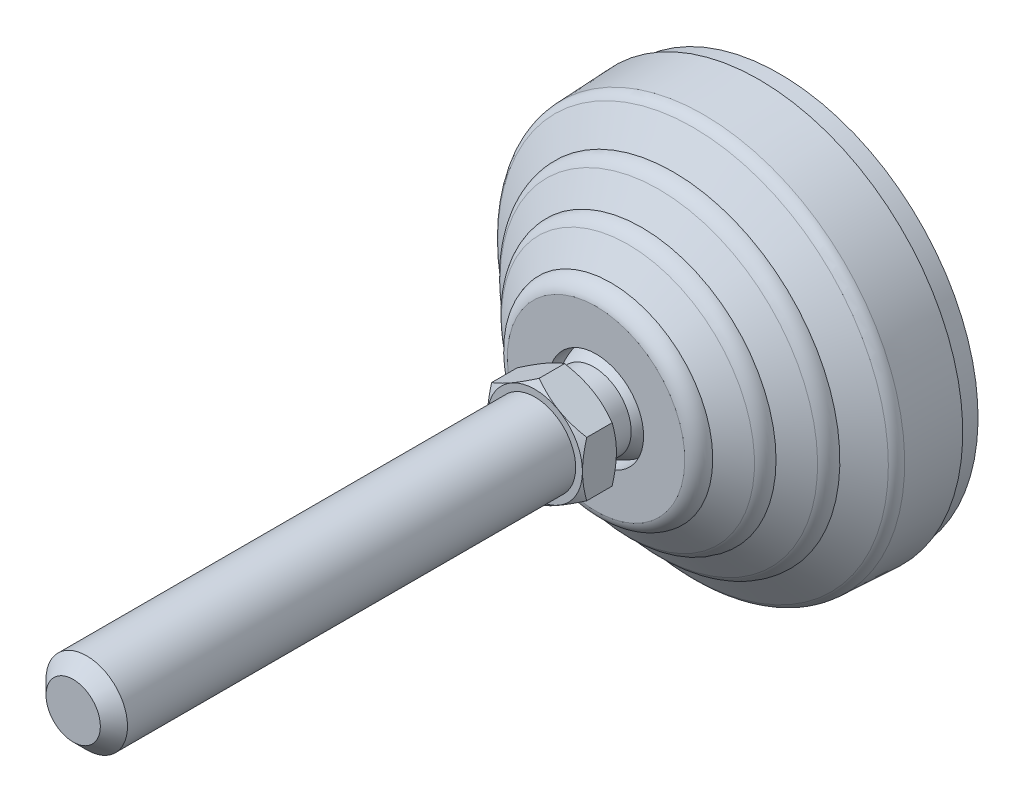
ISO-10303-21;
HEADER;
FILE_DESCRIPTION(('STEP AP214'),'2;1');
FILE_NAME('part.step','',(''),(''),'','','');
FILE_SCHEMA(('AUTOMOTIVE_DESIGN { 1 0 10303 214 1 1 1 1 }'));
ENDSEC;
DATA;
#1=APPLICATION_CONTEXT('core data for automotive mechanical design processes');
#2=APPLICATION_PROTOCOL_DEFINITION('international standard','automotive_design',2000,#1);
#3=PRODUCT_CONTEXT('',#1,'mechanical');
#4=PRODUCT('Part','Part','',(#3));
#5=PRODUCT_RELATED_PRODUCT_CATEGORY('part','',(#4));
#6=PRODUCT_DEFINITION_FORMATION('','',#4);
#7=PRODUCT_DEFINITION_CONTEXT('part definition',#1,'design');
#8=PRODUCT_DEFINITION('design','',#6,#7);
#9=PRODUCT_DEFINITION_SHAPE('','',#8);
#10=(LENGTH_UNIT() NAMED_UNIT(*) SI_UNIT(.MILLI.,.METRE.));
#11=(NAMED_UNIT(*) PLANE_ANGLE_UNIT() SI_UNIT($,.RADIAN.));
#12=(NAMED_UNIT(*) SI_UNIT($,.STERADIAN.) SOLID_ANGLE_UNIT());
#13=UNCERTAINTY_MEASURE_WITH_UNIT(LENGTH_MEASURE(1.E-05),#10,'distance_accuracy_value','');
#14=(GEOMETRIC_REPRESENTATION_CONTEXT(3) GLOBAL_UNCERTAINTY_ASSIGNED_CONTEXT((#13)) GLOBAL_UNIT_ASSIGNED_CONTEXT((#10,
#11,#12)) REPRESENTATION_CONTEXT('',''));
#15=CARTESIAN_POINT('',(0.,0.,0.));
#16=DIRECTION('',(0.,0.,1.));
#17=DIRECTION('',(1.,0.,0.));
#18=AXIS2_PLACEMENT_3D('',#15,#16,#17);
#19=CARTESIAN_POINT('',(0.,0.,35.));
#20=DIRECTION('',(0.,0.,-1.));
#21=DIRECTION('',(0.,1.,0.));
#22=AXIS2_PLACEMENT_3D('',#19,#20,#21);
#23=CYLINDRICAL_SURFACE('',#22,7.);
#24=CARTESIAN_POINT('',(-7.,0.,23.));
#25=CARTESIAN_POINT('',(-7.00000242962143,-0.114537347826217,23.));
#26=CARTESIAN_POINT('',(-6.99718891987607,-0.229074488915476,23.));
#27=CARTESIAN_POINT('',(-6.98594746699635,-0.45787295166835,23.));
#28=CARTESIAN_POINT('',(-6.97751952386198,-0.572134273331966,23.));
#29=CARTESIAN_POINT('',(-6.95506664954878,-0.800105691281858,23.));
#30=CARTESIAN_POINT('',(-6.94104171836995,-0.913815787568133,23.));
#31=CARTESIAN_POINT('',(-6.90742942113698,-1.14041085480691,23.));
#32=CARTESIAN_POINT('',(-6.88784205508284,-1.25329582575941,23.));
#33=CARTESIAN_POINT('',(-6.84315187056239,-1.47796868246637,23.));
#34=CARTESIAN_POINT('',(-6.81804905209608,-1.58975656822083,23.));
#35=CARTESIAN_POINT('',(-6.76238849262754,-1.81196595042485,23.));
#36=CARTESIAN_POINT('',(-6.73183075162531,-1.9223874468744,23.));
#37=CARTESIAN_POINT('',(-6.66533394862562,-2.14159803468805,23.));
#38=CARTESIAN_POINT('',(-6.62939488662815,-2.25038712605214,23.));
#39=CARTESIAN_POINT('',(-6.55222202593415,-2.46607082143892,23.));
#40=CARTESIAN_POINT('',(-6.51098822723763,-2.5729654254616,23.));
#41=CARTESIAN_POINT('',(-6.42332522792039,-2.78460262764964,23.));
#42=CARTESIAN_POINT('',(-6.37689602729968,-2.88934522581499,23.));
#43=CARTESIAN_POINT('',(-6.27895407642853,-3.09642608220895,23.));
#44=CARTESIAN_POINT('',(-6.22744132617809,-3.19876434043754,23.));
#45=CARTESIAN_POINT('',(-6.11945637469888,-3.40078997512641,23.));
#46=CARTESIAN_POINT('',(-6.06298417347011,-3.50047735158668,23.));
#47=CARTESIAN_POINT('',(-5.94521636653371,-3.69696106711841,23.));
#48=CARTESIAN_POINT('',(-5.88392076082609,-3.79375740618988,23.));
#49=CARTESIAN_POINT('',(-5.75665381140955,-3.98422585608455,23.));
#50=CARTESIAN_POINT('',(-5.69068246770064,-4.07789796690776,23.));
#51=CARTESIAN_POINT('',(-5.55422297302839,-4.26189229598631,23.));
#52=CARTESIAN_POINT('',(-5.48373482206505,-4.35221451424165,23.));
#53=CARTESIAN_POINT('',(-5.33841152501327,-4.52929146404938,23.));
#54=CARTESIAN_POINT('',(-5.26357637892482,-4.61604619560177,23.));
#55=CARTESIAN_POINT('',(-5.10973937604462,-4.78577917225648,23.));
#56=CARTESIAN_POINT('',(-5.03073751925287,-4.8687574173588,23.));
#57=CARTESIAN_POINT('',(-4.8687574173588,-5.03073751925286,23.));
#58=CARTESIAN_POINT('',(-4.78577917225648,-5.10973937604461,23.));
#59=CARTESIAN_POINT('',(-4.61604619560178,-5.26357637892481,23.));
#60=CARTESIAN_POINT('',(-4.52929146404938,-5.33841152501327,23.));
#61=CARTESIAN_POINT('',(-4.35221451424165,-5.48373482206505,23.));
#62=CARTESIAN_POINT('',(-4.26189229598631,-5.55422297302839,23.));
#63=CARTESIAN_POINT('',(-4.07789796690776,-5.69068246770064,23.));
#64=CARTESIAN_POINT('',(-3.98422585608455,-5.75665381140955,23.));
#65=CARTESIAN_POINT('',(-3.79375740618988,-5.88392076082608,23.));
#66=CARTESIAN_POINT('',(-3.69696106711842,-5.9452163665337,23.));
#67=CARTESIAN_POINT('',(-3.50047735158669,-6.0629841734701,23.));
#68=CARTESIAN_POINT('',(-3.40078997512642,-6.11945637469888,23.));
#69=CARTESIAN_POINT('',(-3.19876434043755,-6.22744132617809,23.));
#70=CARTESIAN_POINT('',(-3.09642608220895,-6.27895407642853,23.));
#71=CARTESIAN_POINT('',(-2.88934522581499,-6.37689602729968,23.));
#72=CARTESIAN_POINT('',(-2.78460262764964,-6.42332522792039,23.));
#73=CARTESIAN_POINT('',(-2.57296542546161,-6.51098822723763,23.));
#74=CARTESIAN_POINT('',(-2.46607082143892,-6.55222202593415,23.));
#75=CARTESIAN_POINT('',(-2.25038712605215,-6.62939488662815,23.));
#76=CARTESIAN_POINT('',(-2.14159803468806,-6.66533394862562,23.));
#77=CARTESIAN_POINT('',(-1.92238744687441,-6.73183075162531,23.));
#78=CARTESIAN_POINT('',(-1.81196595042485,-6.76238849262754,23.));
#79=CARTESIAN_POINT('',(-1.58975656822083,-6.81804905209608,23.));
#80=CARTESIAN_POINT('',(-1.47796868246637,-6.84315187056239,23.));
#81=CARTESIAN_POINT('',(-1.25329582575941,-6.88784205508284,23.));
#82=CARTESIAN_POINT('',(-1.14041085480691,-6.90742942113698,23.));
#83=CARTESIAN_POINT('',(-0.913815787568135,-6.94104171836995,23.));
#84=CARTESIAN_POINT('',(-0.80010569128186,-6.95506664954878,23.));
#85=CARTESIAN_POINT('',(-0.572134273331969,-6.97751952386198,23.));
#86=CARTESIAN_POINT('',(-0.457872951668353,-6.98594746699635,23.));
#87=CARTESIAN_POINT('',(-0.229074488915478,-6.99718891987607,23.));
#88=CARTESIAN_POINT('',(-0.11453734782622,-7.00000242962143,23.));
#89=CARTESIAN_POINT('',(0.,-7.,23.));
#90=B_SPLINE_CURVE_WITH_KNOTS('',3,(#24,#25,#26,#27,#28,#29,#30,#31,#32,#33,#34,#35,#36,#37,#38,
#39,#40,#41,#42,#43,#44,#45,#46,#47,#48,#49,#50,#51,#52,#53,#54,#55,#56,#57,#58,#59,#60,#61,#62,
#63,#64,#65,#66,#67,#68,#69,#70,#71,#72,#73,#74,#75,#76,#77,#78,#79,#80,#81,#82,#83,#84,#85,#86,
#87,#88,#89),.UNSPECIFIED.,.F.,.F.,(4,2,2,2,2,2,2,2,2,2,2,2,2,2,2,2,2,2,2,2,2,2,2,2,2,2,2,2,2,2,
2,2,4),(0.,0.343577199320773,0.687154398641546,1.03073159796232,1.37430879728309,
1.71788599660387,2.06146319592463,2.40504039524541,2.74861759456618,3.09219479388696,
3.43577199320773,3.7793491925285,4.12292639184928,4.46650359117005,4.81008079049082,
5.15365798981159,5.49723518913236,5.84081238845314,6.18438958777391,6.52796678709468,
6.87154398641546,7.21512118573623,7.558698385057,7.90227558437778,8.24585278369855,
8.58942998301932,8.93300718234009,9.27658438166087,9.62016158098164,9.96373878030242,
10.3073159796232,10.650893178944,10.9944703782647),.UNSPECIFIED.);
#91=CARTESIAN_POINT('',(-7.,0.,23.0001794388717));
#92=VERTEX_POINT('',#91);
#93=CARTESIAN_POINT('',(0.,-7.,23.));
#94=VERTEX_POINT('',#93);
#95=EDGE_CURVE('E138',#92,#94,#90,.T.);
#96=ORIENTED_EDGE('',*,*,#95,.F.);
#97=CARTESIAN_POINT('',(0.,0.,23.));
#98=DIRECTION('',(0.,0.,-1.));
#99=DIRECTION('',(0.,1.,0.));
#100=AXIS2_PLACEMENT_3D('',#97,#98,#99);
#101=CIRCLE('',#100,7.);
#102=CARTESIAN_POINT('',(0.,7.,23.));
#103=VERTEX_POINT('',#102);
#104=EDGE_CURVE('E134',#103,#92,#101,.F.);
#105=ORIENTED_EDGE('',*,*,#104,.F.);
#106=CARTESIAN_POINT('',(7.,0.,23.));
#107=CARTESIAN_POINT('',(7.00000242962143,0.114537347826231,22.9999999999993));
#108=CARTESIAN_POINT('',(6.99718891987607,0.22907448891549,22.9999999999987));
#109=CARTESIAN_POINT('',(6.98594746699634,0.457872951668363,22.9999999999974));
#110=CARTESIAN_POINT('',(6.97751952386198,0.572134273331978,22.9999999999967));
#111=CARTESIAN_POINT('',(6.95506664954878,0.800105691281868,22.9999999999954));
#112=CARTESIAN_POINT('',(6.94104171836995,0.913815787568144,22.9999999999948));
#113=CARTESIAN_POINT('',(6.90742942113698,1.14041085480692,22.9999999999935));
#114=CARTESIAN_POINT('',(6.88784205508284,1.25329582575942,22.9999999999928));
#115=CARTESIAN_POINT('',(6.84315187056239,1.47796868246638,22.9999999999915));
#116=CARTESIAN_POINT('',(6.81804905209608,1.58975656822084,22.9999999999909));
#117=CARTESIAN_POINT('',(6.76238849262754,1.81196595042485,22.9999999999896));
#118=CARTESIAN_POINT('',(6.73183075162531,1.92238744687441,22.999999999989));
#119=CARTESIAN_POINT('',(6.66533394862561,2.14159803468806,22.9999999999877));
#120=CARTESIAN_POINT('',(6.62939488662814,2.25038712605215,22.9999999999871));
#121=CARTESIAN_POINT('',(6.55222202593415,2.46607082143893,22.9999999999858));
#122=CARTESIAN_POINT('',(6.51098822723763,2.57296542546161,22.9999999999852));
#123=CARTESIAN_POINT('',(6.42332522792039,2.78460262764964,22.999999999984));
#124=CARTESIAN_POINT('',(6.37689602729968,2.88934522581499,22.9999999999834));
#125=CARTESIAN_POINT('',(6.27895407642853,3.09642608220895,22.9999999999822));
#126=CARTESIAN_POINT('',(6.22744132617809,3.19876434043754,22.9999999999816));
#127=CARTESIAN_POINT('',(6.11945637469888,3.40078997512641,22.9999999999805));
#128=CARTESIAN_POINT('',(6.06298417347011,3.50047735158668,22.9999999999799));
#129=CARTESIAN_POINT('',(5.94521636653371,3.69696106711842,22.9999999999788));
#130=CARTESIAN_POINT('',(5.88392076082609,3.79375740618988,22.9999999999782));
#131=CARTESIAN_POINT('',(5.75665381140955,3.98422585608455,22.9999999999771));
#132=CARTESIAN_POINT('',(5.69068246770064,4.07789796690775,22.9999999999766));
#133=CARTESIAN_POINT('',(5.55422297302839,4.26189229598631,22.9999999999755));
#134=CARTESIAN_POINT('',(5.48373482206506,4.35221451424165,22.999999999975));
#135=CARTESIAN_POINT('',(5.33841152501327,4.52929146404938,22.999999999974));
#136=CARTESIAN_POINT('',(5.26357637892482,4.61604619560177,22.9999999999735));
#137=CARTESIAN_POINT('',(5.10973937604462,4.78577917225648,22.9999999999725));
#138=CARTESIAN_POINT('',(5.03073751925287,4.8687574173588,22.9999999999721));
#139=CARTESIAN_POINT('',(4.8687574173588,5.03073751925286,22.9999999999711));
#140=CARTESIAN_POINT('',(4.78577917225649,5.10973937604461,22.9999999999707));
#141=CARTESIAN_POINT('',(4.61604619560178,5.26357637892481,22.9999999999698));
#142=CARTESIAN_POINT('',(4.52929146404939,5.33841152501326,22.9999999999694));
#143=CARTESIAN_POINT('',(4.35221451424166,5.48373482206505,22.9999999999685));
#144=CARTESIAN_POINT('',(4.26189229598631,5.55422297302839,22.9999999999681));
#145=CARTESIAN_POINT('',(4.07789796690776,5.69068246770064,22.9999999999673));
#146=CARTESIAN_POINT('',(3.98422585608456,5.75665381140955,22.999999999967));
#147=CARTESIAN_POINT('',(3.79375740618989,5.88392076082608,22.9999999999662));
#148=CARTESIAN_POINT('',(3.69696106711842,5.9452163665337,22.9999999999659));
#149=CARTESIAN_POINT('',(3.50047735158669,6.0629841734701,22.9999999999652));
#150=CARTESIAN_POINT('',(3.40078997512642,6.11945637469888,22.9999999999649));
#151=CARTESIAN_POINT('',(3.19876434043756,6.22744132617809,22.9999999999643));
#152=CARTESIAN_POINT('',(3.09642608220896,6.27895407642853,22.999999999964));
#153=CARTESIAN_POINT('',(2.88934522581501,6.37689602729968,22.9999999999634));
#154=CARTESIAN_POINT('',(2.78460262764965,6.42332522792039,22.9999999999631));
#155=CARTESIAN_POINT('',(2.57296542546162,6.51098822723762,22.9999999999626));
#156=CARTESIAN_POINT('',(2.46607082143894,6.55222202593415,22.9999999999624));
#157=CARTESIAN_POINT('',(2.25038712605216,6.62939488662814,22.999999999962));
#158=CARTESIAN_POINT('',(2.14159803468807,6.66533394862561,22.9999999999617));
#159=CARTESIAN_POINT('',(1.92238744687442,6.73183075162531,22.9999999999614));
#160=CARTESIAN_POINT('',(1.81196595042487,6.76238849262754,22.9999999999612));
#161=CARTESIAN_POINT('',(1.58975656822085,6.81804905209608,22.9999999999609));
#162=CARTESIAN_POINT('',(1.47796868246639,6.84315187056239,22.9999999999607));
#163=CARTESIAN_POINT('',(1.25329582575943,6.88784205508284,22.9999999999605));
#164=CARTESIAN_POINT('',(1.14041085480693,6.90742942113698,22.9999999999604));
#165=CARTESIAN_POINT('',(0.913815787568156,6.94104171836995,22.9999999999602));
#166=CARTESIAN_POINT('',(0.80010569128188,6.95506664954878,22.9999999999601));
#167=CARTESIAN_POINT('',(0.572134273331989,6.97751952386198,22.9999999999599));
#168=CARTESIAN_POINT('',(0.457872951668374,6.98594746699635,22.9999999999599));
#169=CARTESIAN_POINT('',(0.229074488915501,6.99718891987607,22.9999999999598));
#170=CARTESIAN_POINT('',(0.114537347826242,7.00000242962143,22.9999999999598));
#171=CARTESIAN_POINT('',(0.,7.,22.9999999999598));
#172=B_SPLINE_CURVE_WITH_KNOTS('',3,(#106,#107,#108,#109,#110,#111,#112,#113,#114,#115,#116,
#117,#118,#119,#120,#121,#122,#123,#124,#125,#126,#127,#128,#129,#130,#131,#132,#133,#134,#135,
#136,#137,#138,#139,#140,#141,#142,#143,#144,#145,#146,#147,#148,#149,#150,#151,#152,#153,#154,
#155,#156,#157,#158,#159,#160,#161,#162,#163,#164,#165,#166,#167,#168,#169,#170,#171),
.UNSPECIFIED.,.F.,.F.,(4,2,2,2,2,2,2,2,2,2,2,2,2,2,2,2,2,2,2,2,2,2,2,2,2,2,2,2,2,2,2,2,4),(0.,
0.343577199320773,0.687154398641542,1.03073159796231,1.37430879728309,1.71788599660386,
2.06146319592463,2.4050403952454,2.74861759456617,3.09219479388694,3.43577199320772,
3.77934919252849,4.12292639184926,4.46650359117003,4.8100807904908,5.15365798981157,
5.49723518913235,5.84081238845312,6.18438958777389,6.52796678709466,6.87154398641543,
7.21512118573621,7.55869838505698,7.90227558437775,8.24585278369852,8.58942998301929,
8.93300718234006,9.27658438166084,9.62016158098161,9.96373878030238,10.3073159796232,
10.6508931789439,10.9944703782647),.UNSPECIFIED.);
#173=CARTESIAN_POINT('',(7.,0.,23.));
#174=VERTEX_POINT('',#173);
#175=EDGE_CURVE('E31',#174,#103,#172,.T.);
#176=ORIENTED_EDGE('',*,*,#175,.F.);
#177=CARTESIAN_POINT('',(0.,0.,23.));
#178=DIRECTION('',(0.,0.,-1.));
#179=DIRECTION('',(0.,1.,0.));
#180=AXIS2_PLACEMENT_3D('',#177,#178,#179);
#181=CIRCLE('',#180,7.);
#182=EDGE_CURVE('E135',#94,#174,#181,.F.);
#183=ORIENTED_EDGE('',*,*,#182,.F.);
#184=EDGE_LOOP('',(#96,#105,#176,#183));
#185=FACE_BOUND('',#184,.T.);
#186=CARTESIAN_POINT('',(0.,0.,27.));
#187=DIRECTION('',(0.,0.,-1.));
#188=DIRECTION('',(0.,1.,0.));
#189=AXIS2_PLACEMENT_3D('',#186,#187,#188);
#190=CIRCLE('',#189,7.);
#191=CARTESIAN_POINT('',(0.,7.,27.));
#192=VERTEX_POINT('',#191);
#193=EDGE_CURVE('E161',#192,#192,#190,.T.);
#194=ORIENTED_EDGE('',*,*,#193,.F.);
#195=EDGE_LOOP('',(#194));
#196=FACE_BOUND('',#195,.T.);
#197=ADVANCED_FACE('F14',(#185,#196),#23,.F.);
#198=CARTESIAN_POINT('',(-6.53226682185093,0.,27.));
#199=DIRECTION('',(0.,0.,1.));
#200=DIRECTION('',(-1.,0.,0.));
#201=AXIS2_PLACEMENT_3D('',#198,#199,#200);
#202=PLANE('',#201);
#203=CARTESIAN_POINT('',(0.,0.,27.));
#204=DIRECTION('',(0.,0.,-1.));
#205=DIRECTION('',(0.,1.,0.));
#206=AXIS2_PLACEMENT_3D('',#203,#204,#205);
#207=CIRCLE('',#206,13.0645336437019);
#208=CARTESIAN_POINT('',(0.,13.0645336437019,27.));
#209=VERTEX_POINT('',#208);
#210=EDGE_CURVE('E157',#209,#209,#207,.T.);
#211=ORIENTED_EDGE('',*,*,#210,.F.);
#212=EDGE_LOOP('',(#211));
#213=FACE_BOUND('',#212,.T.);
#214=ORIENTED_EDGE('',*,*,#193,.T.);
#215=EDGE_LOOP('',(#214));
#216=FACE_BOUND('',#215,.T.);
#217=ADVANCED_FACE('F310',(#213,#216),#202,.T.);
#218=CARTESIAN_POINT('',(0.,0.,24.5842));
#219=DIRECTION('',(0.,0.,-1.));
#220=DIRECTION('',(0.,1.,0.));
#221=AXIS2_PLACEMENT_3D('',#218,#219,#220);
#222=TOROIDAL_SURFACE('',#221,12.5253,2.47525);
#223=ORIENTED_EDGE('',*,*,#210,.T.);
#224=EDGE_LOOP('',(#223));
#225=FACE_BOUND('',#224,.T.);
#226=CARTESIAN_POINT('',(0.,0.,24.8062186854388));
#227=DIRECTION('',(0.,0.,-1.));
#228=DIRECTION('',(-1.,0.,0.));
#229=AXIS2_PLACEMENT_3D('',#226,#227,#228);
#230=CIRCLE('',#229,14.9905728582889);
#231=CARTESIAN_POINT('',(-14.9905728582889,0.,24.8062186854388));
#232=VERTEX_POINT('',#231);
#233=EDGE_CURVE('E160',#232,#232,#230,.T.);
#234=ORIENTED_EDGE('',*,*,#233,.F.);
#235=EDGE_LOOP('',(#234));
#236=FACE_BOUND('',#235,.T.);
#237=ADVANCED_FACE('F396',(#225,#236),#222,.T.);
#238=CARTESIAN_POINT('',(0.,0.,22.3004110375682));
#239=DIRECTION('',(0.,0.,-1.));
#240=DIRECTION('',(0.,1.,0.));
#241=AXIS2_PLACEMENT_3D('',#238,#239,#240);
#242=CONICAL_SURFACE('',#241,18.63040749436,0.967870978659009);
#243=ORIENTED_EDGE('',*,*,#233,.T.);
#244=EDGE_LOOP('',(#243));
#245=FACE_BOUND('',#244,.T.);
#246=CARTESIAN_POINT('',(0.,0.,22.3004110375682));
#247=DIRECTION('',(0.,0.,-1.));
#248=DIRECTION('',(0.,1.,0.));
#249=AXIS2_PLACEMENT_3D('',#246,#247,#248);
#250=CIRCLE('',#249,18.63040749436);
#251=CARTESIAN_POINT('',(0.,18.63040749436,22.3004110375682));
#252=VERTEX_POINT('',#251);
#253=EDGE_CURVE('E390',#252,#252,#250,.T.);
#254=ORIENTED_EDGE('',*,*,#253,.F.);
#255=EDGE_LOOP('',(#254));
#256=FACE_BOUND('',#255,.T.);
#257=ADVANCED_FACE('F383',(#245,#256),#242,.T.);
#258=CARTESIAN_POINT('',(0.,0.,20.149417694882));
#259=DIRECTION('',(0.,0.,-1.));
#260=DIRECTION('',(0.,1.,0.));
#261=AXIS2_PLACEMENT_3D('',#258,#259,#260);
#262=TOROIDAL_SURFACE('',#261,17.1699621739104,2.59993709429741);
#263=CARTESIAN_POINT('',(0.,0.,20.266146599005));
#264=DIRECTION('',(0.,0.,-1.));
#265=DIRECTION('',(-1.,0.,0.));
#266=AXIS2_PLACEMENT_3D('',#263,#264,#265);
#267=CIRCLE('',#266,19.7672775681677);
#268=CARTESIAN_POINT('',(-19.7672775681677,0.,20.266146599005));
#269=VERTEX_POINT('',#268);
#270=EDGE_CURVE('E387',#269,#269,#267,.T.);
#271=ORIENTED_EDGE('',*,*,#270,.F.);
#272=EDGE_LOOP('',(#271));
#273=FACE_BOUND('',#272,.T.);
#274=ORIENTED_EDGE('',*,*,#253,.T.);
#275=EDGE_LOOP('',(#274));
#276=FACE_BOUND('',#275,.T.);
#277=ADVANCED_FACE('F379',(#273,#276),#262,.T.);
#278=CARTESIAN_POINT('',(0.,0.,17.7704000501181));
#279=DIRECTION('',(0.,0.,-1.));
#280=DIRECTION('',(0.,1.,0.));
#281=AXIS2_PLACEMENT_3D('',#278,#279,#280);
#282=CONICAL_SURFACE('',#281,23.3925000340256,0.967871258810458);
#283=CARTESIAN_POINT('',(0.,0.,17.7704000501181));
#284=DIRECTION('',(0.,0.,-1.));
#285=DIRECTION('',(0.,1.,0.));
#286=AXIS2_PLACEMENT_3D('',#283,#284,#285);
#287=CIRCLE('',#286,23.3925000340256);
#288=CARTESIAN_POINT('',(0.,23.3925000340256,17.7704000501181));
#289=VERTEX_POINT('',#288);
#290=EDGE_CURVE('E368',#289,#289,#287,.T.);
#291=ORIENTED_EDGE('',*,*,#290,.F.);
#292=EDGE_LOOP('',(#291));
#293=FACE_BOUND('',#292,.T.);
#294=ORIENTED_EDGE('',*,*,#270,.T.);
#295=EDGE_LOOP('',(#294));
#296=FACE_BOUND('',#295,.T.);
#297=ADVANCED_FACE('F375',(#293,#296),#282,.T.);
#298=CARTESIAN_POINT('',(0.,0.,15.6193000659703));
#299=DIRECTION('',(0.,0.,-1.));
#300=DIRECTION('',(0.,1.,0.));
#301=AXIS2_PLACEMENT_3D('',#298,#299,#300);
#302=TOROIDAL_SURFACE('',#301,21.9321002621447,2.59999973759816);
#303=ORIENTED_EDGE('',*,*,#290,.T.);
#304=EDGE_LOOP('',(#303));
#305=FACE_BOUND('',#304,.T.);
#306=CARTESIAN_POINT('',(0.,0.,15.6295138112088));
#307=DIRECTION('',(0.,0.,-1.));
#308=DIRECTION('',(-1.,0.,0.));
#309=AXIS2_PLACEMENT_3D('',#306,#307,#308);
#310=CIRCLE('',#309,24.5320799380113);
#311=CARTESIAN_POINT('',(-24.5320799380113,0.,15.6295138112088));
#312=VERTEX_POINT('',#311);
#313=EDGE_CURVE('E365',#312,#312,#310,.T.);
#314=ORIENTED_EDGE('',*,*,#313,.F.);
#315=EDGE_LOOP('',(#314));
#316=FACE_BOUND('',#315,.T.);
#317=ADVANCED_FACE('F372',(#305,#316),#302,.T.);
#318=CARTESIAN_POINT('',(0.,0.,12.7183562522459));
#319=DIRECTION('',(0.,0.,-1.));
#320=DIRECTION('',(0.,1.,0.));
#321=AXIS2_PLACEMENT_3D('',#318,#319,#320);
#322=CONICAL_SURFACE('',#321,28.760790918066,0.967879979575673);
#323=ORIENTED_EDGE('',*,*,#313,.T.);
#324=EDGE_LOOP('',(#323));
#325=FACE_BOUND('',#324,.T.);
#326=CARTESIAN_POINT('',(0.,0.,12.7183562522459));
#327=DIRECTION('',(0.,0.,-1.));
#328=DIRECTION('',(0.,1.,0.));
#329=AXIS2_PLACEMENT_3D('',#326,#327,#328);
#330=CIRCLE('',#329,28.760790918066);
#331=CARTESIAN_POINT('',(0.,28.760790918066,12.7183562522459));
#332=VERTEX_POINT('',#331);
#333=EDGE_CURVE('E362',#332,#332,#330,.T.);
#334=ORIENTED_EDGE('',*,*,#333,.F.);
#335=EDGE_LOOP('',(#334));
#336=FACE_BOUND('',#335,.T.);
#337=ADVANCED_FACE('F355',(#325,#336),#322,.T.);
#338=CARTESIAN_POINT('',(0.,0.,11.0710969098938));
#339=DIRECTION('',(0.,0.,-1.));
#340=DIRECTION('',(0.,1.,0.));
#341=AXIS2_PLACEMENT_3D('',#338,#339,#340);
#342=TOROIDAL_SURFACE('',#341,27.6268354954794,1.9998295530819);
#343=CARTESIAN_POINT('',(0.,0.,11.1756615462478));
#344=DIRECTION('',(0.,0.,-1.));
#345=DIRECTION('',(-1.,0.,0.));
#346=AXIS2_PLACEMENT_3D('',#343,#344,#345);
#347=CIRCLE('',#346,29.6239295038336);
#348=CARTESIAN_POINT('',(-29.6239295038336,0.,11.1756615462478));
#349=VERTEX_POINT('',#348);
#350=EDGE_CURVE('E156',#349,#349,#347,.T.);
#351=ORIENTED_EDGE('',*,*,#350,.F.);
#352=EDGE_LOOP('',(#351));
#353=FACE_BOUND('',#352,.T.);
#354=ORIENTED_EDGE('',*,*,#333,.T.);
#355=EDGE_LOOP('',(#354));
#356=FACE_BOUND('',#355,.T.);
#357=ADVANCED_FACE('F350',(#353,#356),#342,.T.);
#358=CARTESIAN_POINT('',(0.,0.,3.00000000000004));
#359=DIRECTION('',(0.,0.,-1.));
#360=DIRECTION('',(0.,1.,0.));
#361=AXIS2_PLACEMENT_3D('',#358,#359,#360);
#362=CONICAL_SURFACE('',#361,30.,0.0459663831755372);
#363=CARTESIAN_POINT('',(0.,0.,3.));
#364=DIRECTION('',(0.,0.,-1.));
#365=DIRECTION('',(0.,1.,0.));
#366=AXIS2_PLACEMENT_3D('',#363,#364,#365);
#367=CIRCLE('',#366,30.);
#368=CARTESIAN_POINT('',(0.,30.,3.));
#369=VERTEX_POINT('',#368);
#370=EDGE_CURVE('E153',#369,#369,#367,.T.);
#371=ORIENTED_EDGE('',*,*,#370,.F.);
#372=EDGE_LOOP('',(#371));
#373=FACE_BOUND('',#372,.T.);
#374=ORIENTED_EDGE('',*,*,#350,.T.);
#375=EDGE_LOOP('',(#374));
#376=FACE_BOUND('',#375,.T.);
#377=ADVANCED_FACE('F346',(#373,#376),#362,.T.);
#378=CARTESIAN_POINT('',(-29.625,0.,3.));
#379=DIRECTION('',(0.,0.,-1.));
#380=DIRECTION('',(0.,1.,0.));
#381=AXIS2_PLACEMENT_3D('',#378,#379,#380);
#382=PLANE('',#381);
#383=ORIENTED_EDGE('',*,*,#370,.T.);
#384=EDGE_LOOP('',(#383));
#385=FACE_BOUND('',#384,.T.);
#386=CARTESIAN_POINT('',(0.,0.,3.));
#387=DIRECTION('',(0.,0.,1.));
#388=DIRECTION('',(0.,-1.,0.));
#389=AXIS2_PLACEMENT_3D('',#386,#387,#388);
#390=CIRCLE('',#389,29.25);
#391=CARTESIAN_POINT('',(0.,-29.25,3.));
#392=VERTEX_POINT('',#391);
#393=EDGE_CURVE('E150',#392,#392,#390,.F.);
#394=ORIENTED_EDGE('',*,*,#393,.F.);
#395=EDGE_LOOP('',(#394));
#396=FACE_BOUND('',#395,.T.);
#397=ADVANCED_FACE('F342',(#385,#396),#382,.T.);
#398=CARTESIAN_POINT('',(0.,0.,1.5));
#399=DIRECTION('',(0.,0.,1.));
#400=DIRECTION('',(0.,-1.,0.));
#401=AXIS2_PLACEMENT_3D('',#398,#399,#400);
#402=CYLINDRICAL_SURFACE('',#401,29.25);
#403=CARTESIAN_POINT('',(0.,0.,0.));
#404=DIRECTION('',(0.,0.,1.));
#405=DIRECTION('',(0.,-1.,0.));
#406=AXIS2_PLACEMENT_3D('',#403,#404,#405);
#407=CIRCLE('',#406,29.25);
#408=CARTESIAN_POINT('',(0.,-29.25,0.));
#409=VERTEX_POINT('',#408);
#410=EDGE_CURVE('E147',#409,#409,#407,.F.);
#411=ORIENTED_EDGE('',*,*,#410,.F.);
#412=EDGE_LOOP('',(#411));
#413=FACE_BOUND('',#412,.T.);
#414=ORIENTED_EDGE('',*,*,#393,.T.);
#415=EDGE_LOOP('',(#414));
#416=FACE_BOUND('',#415,.T.);
#417=ADVANCED_FACE('F302',(#413,#416),#402,.T.);
#418=CARTESIAN_POINT('',(-14.625,0.,0.));
#419=DIRECTION('',(0.,0.,-1.));
#420=DIRECTION('',(0.,1.,0.));
#421=AXIS2_PLACEMENT_3D('',#418,#419,#420);
#422=PLANE('',#421);
#423=ORIENTED_EDGE('',*,*,#410,.T.);
#424=EDGE_LOOP('',(#423));
#425=FACE_BOUND('',#424,.T.);
#426=ADVANCED_FACE('F117',(#425),#422,.T.);
#427=CARTESIAN_POINT('',(0.,0.,56.4265));
#428=DIRECTION('',(0.,0.,-1.));
#429=DIRECTION('',(0.,1.,0.));
#430=AXIS2_PLACEMENT_3D('',#427,#428,#429);
#431=CYLINDRICAL_SURFACE('',#430,6.);
#432=CARTESIAN_POINT('',(0.,0.,102.));
#433=DIRECTION('',(0.,0.,1.));
#434=DIRECTION('',(0.,-1.,0.));
#435=AXIS2_PLACEMENT_3D('',#432,#433,#434);
#436=CIRCLE('',#435,6.);
#437=CARTESIAN_POINT('',(0.,-6.,102.));
#438=VERTEX_POINT('',#437);
#439=EDGE_CURVE('E9',#438,#438,#436,.F.);
#440=ORIENTED_EDGE('',*,*,#439,.T.);
#441=EDGE_LOOP('',(#440));
#442=FACE_BOUND('',#441,.T.);
#443=CARTESIAN_POINT('',(0.,0.,36.));
#444=DIRECTION('',(0.,0.,-1.));
#445=DIRECTION('',(0.,1.,0.));
#446=AXIS2_PLACEMENT_3D('',#443,#444,#445);
#447=CIRCLE('',#446,6.);
#448=CARTESIAN_POINT('',(0.,6.,36.));
#449=VERTEX_POINT('',#448);
#450=EDGE_CURVE('E136',#449,#449,#447,.F.);
#451=ORIENTED_EDGE('',*,*,#450,.T.);
#452=EDGE_LOOP('',(#451));
#453=FACE_BOUND('',#452,.T.);
#454=ADVANCED_FACE('F293',(#442,#453),#431,.T.);
#455=CARTESIAN_POINT('',(6.495,0.,36.));
#456=DIRECTION('',(0.,0.,1.));
#457=DIRECTION('',(0.,-1.,0.));
#458=AXIS2_PLACEMENT_3D('',#455,#456,#457);
#459=PLANE('',#458);
#460=CARTESIAN_POINT('',(0.,0.,36.));
#461=DIRECTION('',(0.,0.,-1.));
#462=DIRECTION('',(0.,1.,0.));
#463=AXIS2_PLACEMENT_3D('',#460,#461,#462);
#464=CIRCLE('',#463,6.99);
#465=CARTESIAN_POINT('',(0.,6.99,36.));
#466=VERTEX_POINT('',#465);
#467=EDGE_CURVE('E601',#466,#466,#464,.F.);
#468=ORIENTED_EDGE('',*,*,#467,.T.);
#469=EDGE_LOOP('',(#468));
#470=FACE_BOUND('',#469,.T.);
#471=ORIENTED_EDGE('',*,*,#450,.F.);
#472=EDGE_LOOP('',(#471));
#473=FACE_BOUND('',#472,.T.);
#474=ADVANCED_FACE('F260',(#470,#473),#459,.T.);
#475=CARTESIAN_POINT('',(0.,0.,35.3652257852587));
#476=DIRECTION('',(0.,0.,-1.));
#477=DIRECTION('',(0.,1.,0.));
#478=AXIS2_PLACEMENT_3D('',#475,#476,#477);
#479=CONICAL_SURFACE('',#478,8.08946119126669,1.0471975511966);
#480=ORIENTED_EDGE('',*,*,#467,.F.);
#481=EDGE_LOOP('',(#480));
#482=FACE_BOUND('',#481,.T.);
#483=CARTESIAN_POINT('',(-2.30772558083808E-08,8.0829037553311,35.3690117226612));
#484=CARTESIAN_POINT('',(-0.153866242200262,7.99406905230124,35.4202905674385));
#485=CARTESIAN_POINT('',(-0.30830614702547,7.90490313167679,35.4692419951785));
#486=CARTESIAN_POINT('',(-0.618440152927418,7.72584717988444,35.5618490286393));
#487=CARTESIAN_POINT('',(-0.774134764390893,7.63595685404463,35.6055023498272));
#488=CARTESIAN_POINT('',(-1.24371128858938,7.3648467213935,35.7276582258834));
#489=CARTESIAN_POINT('',(-1.55944671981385,7.18255678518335,35.7971380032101));
#490=CARTESIAN_POINT('',(-2.03193900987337,6.90976323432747,35.878609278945));
#491=CARTESIAN_POINT('',(-2.18728424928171,6.82007461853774,35.9018177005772));
#492=CARTESIAN_POINT('',(-2.49867655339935,6.64029218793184,35.9407339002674));
#493=CARTESIAN_POINT('',(-2.65472355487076,6.55019840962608,35.9564423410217));
#494=CARTESIAN_POINT('',(-2.96708848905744,6.369854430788,35.9799582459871));
#495=CARTESIAN_POINT('',(-3.1234059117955,6.27960452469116,35.98777467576));
#496=CARTESIAN_POINT('',(-3.43617641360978,6.09902639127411,35.9953473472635));
#497=CARTESIAN_POINT('',(-3.59262948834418,6.00869816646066,35.9951038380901));
#498=CARTESIAN_POINT('',(-4.02123302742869,5.76124379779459,35.9833586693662));
#499=CARTESIAN_POINT('',(-4.29324310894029,5.60419870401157,35.9636515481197));
#500=CARTESIAN_POINT('',(-4.83545665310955,5.2911515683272,35.9011668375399));
#501=CARTESIAN_POINT('',(-5.10565820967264,5.13515062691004,35.8583679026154));
#502=CARTESIAN_POINT('',(-5.64896246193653,4.82147377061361,35.7513856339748));
#503=CARTESIAN_POINT('',(-5.92199662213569,4.66383742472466,35.6867491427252));
#504=CARTESIAN_POINT('',(-6.46399382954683,4.35091519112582,35.5400514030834));
#505=CARTESIAN_POINT('',(-6.73296381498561,4.19562529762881,35.4580246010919));
#506=CARTESIAN_POINT('',(-6.99999992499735,4.04145192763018,35.3690117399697));
#507=B_SPLINE_CURVE_WITH_KNOTS('',3,(#483,#484,#485,#486,#487,#488,#489,#490,#491,#492,#493,
#494,#495,#496,#497,#498,#499,#500,#501,#502,#503,#504,#505,#506),.UNSPECIFIED.,.F.,.F.,(4,2,2,
2,2,2,2,2,2,2,2,4),(0.,0.554720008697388,1.10967836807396,2.22190068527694,2.76439120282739,
3.30683377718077,3.8486594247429,4.39046832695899,5.33360242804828,6.27760984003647,
7.24255081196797,8.20559801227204),.UNSPECIFIED.);
#508=CARTESIAN_POINT('',(-1.15386261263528E-08,8.08290376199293,35.369011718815));
#509=VERTEX_POINT('',#508);
#510=CARTESIAN_POINT('',(-7.,4.04145190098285,35.3690117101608));
#511=VERTEX_POINT('',#510);
#512=EDGE_CURVE('E100',#509,#511,#507,.T.);
#513=ORIENTED_EDGE('',*,*,#512,.T.);
#514=CARTESIAN_POINT('',(-7.,4.04145191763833,35.3690117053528));
#515=CARTESIAN_POINT('',(-7.,3.70968878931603,35.4647934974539));
#516=CARTESIAN_POINT('',(-7.,3.37530112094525,35.5524844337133));
#517=CARTESIAN_POINT('',(-7.,2.70109388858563,35.7074672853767));
#518=CARTESIAN_POINT('',(-7.,2.36126392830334,35.7747135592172));
#519=CARTESIAN_POINT('',(-7.,1.68541720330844,35.882853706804));
#520=CARTESIAN_POINT('',(-7.,1.34949559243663,35.9243241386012));
#521=CARTESIAN_POINT('',(-7.,0.675714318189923,35.9799957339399));
#522=CARTESIAN_POINT('',(-7.,0.337857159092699,35.9942264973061));
#523=CARTESIAN_POINT('',(-7.,-0.337857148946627,35.9942264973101));
#524=CARTESIAN_POINT('',(-7.,-0.67571429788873,35.9799957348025));
#525=CARTESIAN_POINT('',(-7.,-1.34949555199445,35.9243241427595));
#526=CARTESIAN_POINT('',(-7.,-1.68541715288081,35.8828537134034));
#527=CARTESIAN_POINT('',(-7.,-2.3612638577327,35.7747135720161));
#528=CARTESIAN_POINT('',(-7.,-2.70109380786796,35.7074673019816));
#529=CARTESIAN_POINT('',(-7.,-3.37530102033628,35.5524844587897));
#530=CARTESIAN_POINT('',(-7.,-3.70968867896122,35.4647935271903));
#531=CARTESIAN_POINT('',(-7.,-4.04145179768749,35.3690117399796));
#532=B_SPLINE_CURVE_WITH_KNOTS('',3,(#514,#515,#516,#517,#518,#519,#520,#521,#522,#523,#524,
#525,#526,#527,#528,#529,#530,#531),.UNSPECIFIED.,.F.,.F.,(4,2,2,2,2,2,2,2,4),(0.,
1.03625689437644,2.07481046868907,3.08920803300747,4.10250268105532,5.11579729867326,
6.1301948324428,7.16874837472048,8.2050052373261),.UNSPECIFIED.);
#533=CARTESIAN_POINT('',(-7.00000001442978,-4.04145187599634,35.3690117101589));
#534=VERTEX_POINT('',#533);
#535=EDGE_CURVE('E274',#511,#534,#532,.T.);
#536=ORIENTED_EDGE('',*,*,#535,.T.);
#537=CARTESIAN_POINT('',(-7.00000002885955,-4.04145186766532,35.369011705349));
#538=CARTESIAN_POINT('',(-6.84613380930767,-4.13028657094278,35.4202905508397));
#539=CARTESIAN_POINT('',(-6.6916939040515,-4.21945249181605,35.4692419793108));
#540=CARTESIAN_POINT('',(-6.38155989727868,-4.39850844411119,35.5618490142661));
#541=CARTESIAN_POINT('',(-6.22586528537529,-4.48839877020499,35.6055023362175));
#542=CARTESIAN_POINT('',(-5.7562887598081,-4.75950890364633,35.7276582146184));
#543=CARTESIAN_POINT('',(-5.4405533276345,-4.94179884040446,35.7971379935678));
#544=CARTESIAN_POINT('',(-4.96806103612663,-5.21459239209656,35.8786092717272));
#545=CARTESIAN_POINT('',(-4.8127157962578,-5.30428100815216,35.9018176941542));
#546=CARTESIAN_POINT('',(-4.50132349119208,-5.48406343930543,35.9407338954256));
#547=CARTESIAN_POINT('',(-4.34527648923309,-5.57415721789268,35.9564423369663));
#548=CARTESIAN_POINT('',(-4.03291155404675,-5.75450119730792,35.9799582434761));
#549=CARTESIAN_POINT('',(-3.87659413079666,-5.84475110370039,35.9877746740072));
#550=CARTESIAN_POINT('',(-3.56382362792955,-6.02532923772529,35.9953473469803));
#551=CARTESIAN_POINT('',(-3.40737055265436,-6.11565746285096,35.9951038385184));
#552=CARTESIAN_POINT('',(-2.97876700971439,-6.36311183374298,35.9833586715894));
#553=CARTESIAN_POINT('',(-2.70675692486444,-6.52015692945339,35.9636515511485));
#554=CARTESIAN_POINT('',(-2.16454337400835,-6.83320406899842,35.9011668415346));
#555=CARTESIAN_POINT('',(-1.89434181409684,-6.98920501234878,35.8583679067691));
#556=CARTESIAN_POINT('',(-1.35103755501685,-7.30288187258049,35.7513856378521));
#557=CARTESIAN_POINT('',(-1.0780033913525,-7.46051822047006,35.6867491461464));
#558=CARTESIAN_POINT('',(-0.536006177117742,-7.77344045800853,35.5400514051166));
#559=CARTESIAN_POINT('',(-0.267036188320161,-7.92873035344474,35.4580246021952));
#560=CARTESIAN_POINT('',(-7.50026377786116E-08,-8.08290372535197,35.3690117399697));
#561=B_SPLINE_CURVE_WITH_KNOTS('',3,(#537,#538,#539,#540,#541,#542,#543,#544,#545,#546,#547,
#548,#549,#550,#551,#552,#553,#554,#555,#556,#557,#558,#559,#560),.UNSPECIFIED.,.F.,.F.,(4,2,2,
2,2,2,2,2,2,2,2,4),(0.,0.55472001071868,1.10967837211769,2.22190069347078,2.76439121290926,
3.30683378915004,3.84865943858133,4.39046834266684,5.33360245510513,6.27760987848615,
7.24255086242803,8.20559807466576),.UNSPECIFIED.);
#562=CARTESIAN_POINT('',(-1.44240629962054E-08,-8.0829037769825,35.3690117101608));
#563=VERTEX_POINT('',#562);
#564=EDGE_CURVE('E245',#534,#563,#561,.T.);
#565=ORIENTED_EDGE('',*,*,#564,.T.);
#566=CARTESIAN_POINT('',(-2.884812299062E-08,-8.08290378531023,35.3690117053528));
#567=CARTESIAN_POINT('',(0.153866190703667,-7.99406908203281,35.4202905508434));
#568=CARTESIAN_POINT('',(0.308306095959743,-7.9049031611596,35.4692419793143));
#569=CARTESIAN_POINT('',(0.618440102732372,-7.72584720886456,35.5618490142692));
#570=CARTESIAN_POINT('',(0.774134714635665,-7.63595688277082,35.6055023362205));
#571=CARTESIAN_POINT('',(1.24371124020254,-7.36484674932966,35.7276582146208));
#572=CARTESIAN_POINT('',(1.55944667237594,-7.18255681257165,35.79713799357));
#573=CARTESIAN_POINT('',(2.03193896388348,-6.90976326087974,35.8786092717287));
#574=CARTESIAN_POINT('',(2.18728420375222,-6.8200746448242,35.9018176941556));
#575=CARTESIAN_POINT('',(2.49867650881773,-6.64029221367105,35.9407338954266));
#576=CARTESIAN_POINT('',(2.65472351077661,-6.55019843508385,35.9564423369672));
#577=CARTESIAN_POINT('',(2.96708844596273,-6.36985445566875,35.9799582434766));
#578=CARTESIAN_POINT('',(3.12340586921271,-6.27960454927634,35.9877746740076));
#579=CARTESIAN_POINT('',(3.43617637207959,-6.09902641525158,35.9953473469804));
#580=CARTESIAN_POINT('',(3.59262944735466,-6.00869819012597,35.9951038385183));
#581=CARTESIAN_POINT('',(4.02123299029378,-5.76124381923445,35.9833586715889));
#582=CARTESIAN_POINT('',(4.29324307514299,-5.60419872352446,35.9636515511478));
#583=CARTESIAN_POINT('',(4.8354566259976,-5.29115158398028,35.9011668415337));
#584=CARTESIAN_POINT('',(5.10565818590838,-5.13515064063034,35.8583679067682));
#585=CARTESIAN_POINT('',(5.64896244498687,-4.8214737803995,35.7513856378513));
#586=CARTESIAN_POINT('',(5.92199660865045,-4.66383743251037,35.6867491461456));
#587=CARTESIAN_POINT('',(6.46399382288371,-4.35091519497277,35.5400514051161));
#588=CARTESIAN_POINT('',(6.73296381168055,-4.19562529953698,35.4580246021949));
#589=CARTESIAN_POINT('',(6.99999992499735,-4.04145192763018,35.3690117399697));
#590=B_SPLINE_CURVE_WITH_KNOTS('',3,(#566,#567,#568,#569,#570,#571,#572,#573,#574,#575,#576,
#577,#578,#579,#580,#581,#582,#583,#584,#585,#586,#587,#588,#589),.UNSPECIFIED.,.F.,.F.,(4,2,2,
2,2,2,2,2,2,2,2,4),(0.,0.554720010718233,1.1096783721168,2.22190069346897,2.76439121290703,
3.30683378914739,3.84865943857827,4.39046834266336,5.33360245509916,6.27760987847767,
7.24255086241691,8.20559807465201),.UNSPECIFIED.);
#591=CARTESIAN_POINT('',(7.,-4.04145190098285,35.3690117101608));
#592=VERTEX_POINT('',#591);
#593=EDGE_CURVE('E236',#563,#592,#590,.T.);
#594=ORIENTED_EDGE('',*,*,#593,.T.);
#595=CARTESIAN_POINT('',(7.,-4.04145191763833,35.3690117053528));
#596=CARTESIAN_POINT('',(7.,-3.70968878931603,35.4647934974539));
#597=CARTESIAN_POINT('',(7.,-3.37530112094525,35.5524844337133));
#598=CARTESIAN_POINT('',(7.,-2.70109388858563,35.7074672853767));
#599=CARTESIAN_POINT('',(7.,-2.36126392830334,35.7747135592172));
#600=CARTESIAN_POINT('',(7.,-1.68541720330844,35.882853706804));
#601=CARTESIAN_POINT('',(7.,-1.34949559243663,35.9243241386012));
#602=CARTESIAN_POINT('',(7.,-0.675714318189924,35.9799957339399));
#603=CARTESIAN_POINT('',(7.,-0.3378571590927,35.9942264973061));
#604=CARTESIAN_POINT('',(7.,0.337857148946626,35.9942264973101));
#605=CARTESIAN_POINT('',(7.,0.675714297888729,35.9799957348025));
#606=CARTESIAN_POINT('',(7.,1.34949555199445,35.9243241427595));
#607=CARTESIAN_POINT('',(7.,1.68541715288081,35.8828537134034));
#608=CARTESIAN_POINT('',(7.,2.3612638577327,35.7747135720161));
#609=CARTESIAN_POINT('',(7.,2.70109380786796,35.7074673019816));
#610=CARTESIAN_POINT('',(7.,3.37530102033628,35.5524844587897));
#611=CARTESIAN_POINT('',(7.,3.70968867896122,35.4647935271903));
#612=CARTESIAN_POINT('',(7.,4.04145179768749,35.3690117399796));
#613=B_SPLINE_CURVE_WITH_KNOTS('',3,(#595,#596,#597,#598,#599,#600,#601,#602,#603,#604,#605,
#606,#607,#608,#609,#610,#611,#612),.UNSPECIFIED.,.F.,.F.,(4,2,2,2,2,2,2,2,4),(0.,
1.03625689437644,2.07481046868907,3.08920803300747,4.10250268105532,5.11579729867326,
6.13019483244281,7.16874837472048,8.2050052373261),.UNSPECIFIED.);
#614=CARTESIAN_POINT('',(7.00000001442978,4.04145187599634,35.3690117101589));
#615=VERTEX_POINT('',#614);
#616=EDGE_CURVE('E244',#592,#615,#613,.T.);
#617=ORIENTED_EDGE('',*,*,#616,.T.);
#618=CARTESIAN_POINT('',(7.00000002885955,4.04145186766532,35.369011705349));
#619=CARTESIAN_POINT('',(6.84613380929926,4.13028657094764,35.4202905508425));
#620=CARTESIAN_POINT('',(6.69169390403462,4.2194524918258,35.4692419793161));
#621=CARTESIAN_POINT('',(6.3815598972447,4.39850844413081,35.5618490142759));
#622=CARTESIAN_POINT('',(6.2258652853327,4.48839877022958,35.6055023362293));
#623=CARTESIAN_POINT('',(5.75628875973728,4.75950890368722,35.7276582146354));
#624=CARTESIAN_POINT('',(5.44055332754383,4.94179884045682,35.797137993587));
#625=CARTESIAN_POINT('',(4.96806103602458,5.21459239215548,35.8786092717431));
#626=CARTESIAN_POINT('',(4.81271579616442,5.30428100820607,35.9018176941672));
#627=CARTESIAN_POINT('',(4.50132349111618,5.48406343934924,35.9407338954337));
#628=CARTESIAN_POINT('',(4.345276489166,5.57415721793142,35.9564423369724));
#629=CARTESIAN_POINT('',(4.0329115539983,5.75450119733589,35.9799582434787));
#630=CARTESIAN_POINT('',(3.87659413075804,5.84475110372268,35.9877746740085));
#631=CARTESIAN_POINT('',(3.56382362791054,6.02532923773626,35.9953473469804));
#632=CARTESIAN_POINT('',(3.40737055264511,6.1156574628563,35.9951038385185));
#633=CARTESIAN_POINT('',(2.97876700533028,6.36311183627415,35.9833586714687));
#634=CARTESIAN_POINT('',(2.70675691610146,6.5201569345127,35.9636515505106));
#635=CARTESIAN_POINT('',(2.16454335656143,6.8332040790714,35.9011668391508));
#636=CARTESIAN_POINT('',(1.89434179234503,6.9892050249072,35.8583679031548));
#637=CARTESIAN_POINT('',(1.35103752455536,7.30288189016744,35.7513856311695));
#638=CARTESIAN_POINT('',(1.07800335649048,7.46051824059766,35.6867491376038));
#639=CARTESIAN_POINT('',(0.536006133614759,7.77344048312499,35.5400513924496));
#640=CARTESIAN_POINT('',(0.267036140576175,7.92873038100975,35.4580245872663));
#641=CARTESIAN_POINT('',(2.30772582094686E-08,8.0829037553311,35.3690117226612));
#642=B_SPLINE_CURVE_WITH_KNOTS('',3,(#618,#619,#620,#621,#622,#623,#624,#625,#626,#627,#628,
#629,#630,#631,#632,#633,#634,#635,#636,#637,#638,#639,#640,#641),.UNSPECIFIED.,.F.,.F.,(4,2,2,
2,2,2,2,2,2,2,2,4),(0.,0.554720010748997,1.10967837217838,2.22190069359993,2.7643912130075,
3.30683378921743,3.84865943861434,4.3904683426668,5.33360247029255,6.2776099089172,
7.24255090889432,8.20559813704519),.UNSPECIFIED.);
#643=EDGE_CURVE('E265',#615,#509,#642,.T.);
#644=ORIENTED_EDGE('',*,*,#643,.T.);
#645=EDGE_LOOP('',(#513,#536,#565,#594,#617,#644));
#646=FACE_BOUND('',#645,.T.);
#647=ADVANCED_FACE('F256',(#482,#646),#479,.T.);
#648=CARTESIAN_POINT('',(0.,-8.08290376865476,36.1));
#649=DIRECTION('',(0.5,0.866025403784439,0.));
#650=DIRECTION('',(-0.866025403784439,0.5,0.));
#651=AXIS2_PLACEMENT_3D('',#648,#649,#650);
#652=PLANE('',#651);
#653=DIRECTION('',(0.,0.,1.));
#654=VECTOR('',#653,1.);
#655=CARTESIAN_POINT('',(0.,-8.08290376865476,36.1));
#656=LINE('',#655,#654);
#657=CARTESIAN_POINT('',(0.,-8.08290376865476,31.6309882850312));
#658=VERTEX_POINT('',#657);
#659=EDGE_CURVE('E169',#658,#563,#656,.T.);
#660=ORIENTED_EDGE('',*,*,#659,.T.);
#661=ORIENTED_EDGE('',*,*,#564,.F.);
#662=DIRECTION('',(0.,0.,1.));
#663=VECTOR('',#662,1.);
#664=CARTESIAN_POINT('',(-7.,-4.04145188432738,36.1));
#665=LINE('',#664,#663);
#666=CARTESIAN_POINT('',(-7.,-4.04145188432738,31.6309882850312));
#667=VERTEX_POINT('',#666);
#668=EDGE_CURVE('E171',#667,#534,#665,.T.);
#669=ORIENTED_EDGE('',*,*,#668,.F.);
#670=CARTESIAN_POINT('',(0.,-8.08290376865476,31.6309882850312));
#671=CARTESIAN_POINT('',(-0.153866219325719,-7.99406906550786,31.5797094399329));
#672=CARTESIAN_POINT('',(-0.308306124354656,-7.90490314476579,31.5307580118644));
#673=CARTESIAN_POINT('',(-0.618440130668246,-7.72584719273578,31.4381509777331));
#674=CARTESIAN_POINT('',(-0.774134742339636,-7.63595686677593,31.3944976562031));
#675=CARTESIAN_POINT('',(-1.24371126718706,-7.36484673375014,31.2723417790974));
#676=CARTESIAN_POINT('',(-1.55944669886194,-7.18255679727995,31.2028620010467));
#677=CARTESIAN_POINT('',(-2.03193898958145,-6.90976324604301,31.1213907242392));
#678=CARTESIAN_POINT('',(-2.18728422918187,-6.82007463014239,31.098182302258));
#679=CARTESIAN_POINT('',(-2.49867653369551,-6.64029219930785,31.0592661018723));
#680=CARTESIAN_POINT('',(-2.65472353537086,-6.55019842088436,31.0435576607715));
#681=CARTESIAN_POINT('',(-2.96708846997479,-6.36985444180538,31.0200417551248));
#682=CARTESIAN_POINT('',(-3.12340589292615,-6.27960453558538,31.012225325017));
#683=CARTESIAN_POINT('',(-3.43617639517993,-6.09902640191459,31.0046526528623));
#684=CARTESIAN_POINT('',(-3.59262947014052,-6.00869817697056,31.0048961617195));
#685=CARTESIAN_POINT('',(-4.02123301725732,-5.76124380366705,31.0166413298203));
#686=CARTESIAN_POINT('',(-4.29324310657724,-5.60419870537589,31.0363484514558));
#687=CARTESIAN_POINT('',(-4.83545666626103,-5.29115156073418,31.0988331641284));
#688=CARTESIAN_POINT('',(-5.10565823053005,-5.135150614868,31.1416321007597));
#689=CARTESIAN_POINT('',(-5.64896249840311,-4.82147374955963,31.248614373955));
#690=CARTESIAN_POINT('',(-5.92199666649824,-4.66383739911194,31.3132508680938));
#691=CARTESIAN_POINT('',(-6.46399388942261,-4.35091515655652,31.4599486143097));
#692=CARTESIAN_POINT('',(-6.73296388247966,-4.1956252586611,31.5419754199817));
#693=CARTESIAN_POINT('',(-7.,-4.04145188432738,31.6309882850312));
#694=B_SPLINE_CURVE_WITH_KNOTS('',3,(#670,#671,#672,#673,#674,#675,#676,#677,#678,#679,#680,
#681,#682,#683,#684,#685,#686,#687,#688,#689,#690,#691,#692,#693),.UNSPECIFIED.,.F.,.F.,(4,2,2,
2,2,2,2,2,2,2,2,4),(0.,0.554720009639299,1.10967836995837,2.22190068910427,2.76439120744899,
3.30683378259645,3.84865943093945,4.39046833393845,5.3336024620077,6.2776099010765,
7.24255090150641,8.20559813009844),.UNSPECIFIED.);
#695=EDGE_CURVE('E170',#658,#667,#694,.T.);
#696=ORIENTED_EDGE('',*,*,#695,.F.);
#697=EDGE_LOOP('',(#660,#661,#669,#696));
#698=FACE_BOUND('',#697,.T.);
#699=ADVANCED_FACE('F228',(#698),#652,.F.);
#700=CARTESIAN_POINT('',(7.,-4.04145188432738,36.1));
#701=DIRECTION('',(-0.5,0.866025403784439,0.));
#702=DIRECTION('',(-0.866025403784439,-0.5,0.));
#703=AXIS2_PLACEMENT_3D('',#700,#701,#702);
#704=PLANE('',#703);
#705=DIRECTION('',(0.,0.,1.));
#706=VECTOR('',#705,1.);
#707=CARTESIAN_POINT('',(7.,-4.04145188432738,36.1));
#708=LINE('',#707,#706);
#709=CARTESIAN_POINT('',(7.,-4.04145188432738,31.6309882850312));
#710=VERTEX_POINT('',#709);
#711=EDGE_CURVE('E166',#710,#592,#708,.T.);
#712=ORIENTED_EDGE('',*,*,#711,.T.);
#713=ORIENTED_EDGE('',*,*,#593,.F.);
#714=ORIENTED_EDGE('',*,*,#659,.F.);
#715=CARTESIAN_POINT('',(7.,-4.04145188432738,31.6309882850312));
#716=CARTESIAN_POINT('',(6.84613378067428,-4.13028658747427,31.5797094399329));
#717=CARTESIAN_POINT('',(6.69169387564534,-4.21945250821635,31.5307580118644));
#718=CARTESIAN_POINT('',(6.38155986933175,-4.39850846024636,31.4381509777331));
#719=CARTESIAN_POINT('',(6.22586525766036,-4.48839878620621,31.3944976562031));
#720=CARTESIAN_POINT('',(5.75628873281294,-4.759508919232,31.2723417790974));
#721=CARTESIAN_POINT('',(5.44055330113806,-4.94179885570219,31.2028620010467));
#722=CARTESIAN_POINT('',(4.96806101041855,-5.21459240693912,31.1213907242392));
#723=CARTESIAN_POINT('',(4.81271577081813,-5.30428102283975,31.098182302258));
#724=CARTESIAN_POINT('',(4.50132346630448,-5.48406345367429,31.0592661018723));
#725=CARTESIAN_POINT('',(4.34527646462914,-5.57415723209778,31.0435576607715));
#726=CARTESIAN_POINT('',(4.0329115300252,-5.75450121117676,31.0200417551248));
#727=CARTESIAN_POINT('',(3.87659410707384,-5.84475111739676,31.012225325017));
#728=CARTESIAN_POINT('',(3.56382360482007,-6.02532925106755,31.0046526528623));
#729=CARTESIAN_POINT('',(3.40737052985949,-6.11565747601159,31.0048961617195));
#730=CARTESIAN_POINT('',(2.97876698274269,-6.36311184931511,31.0166413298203));
#731=CARTESIAN_POINT('',(2.70675689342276,-6.52015694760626,31.0363484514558));
#732=CARTESIAN_POINT('',(2.16454333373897,-6.83320409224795,31.0988331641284));
#733=CARTESIAN_POINT('',(1.89434176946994,-6.98920503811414,31.1416321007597));
#734=CARTESIAN_POINT('',(1.35103750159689,-7.30288190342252,31.248614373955));
#735=CARTESIAN_POINT('',(1.07800333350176,-7.4605182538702,31.3132508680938));
#736=CARTESIAN_POINT('',(0.536006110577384,-7.77344049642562,31.4599486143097));
#737=CARTESIAN_POINT('',(0.26703611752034,-7.92873039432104,31.5419754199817));
#738=CARTESIAN_POINT('',(0.,-8.08290376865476,31.6309882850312));
#739=B_SPLINE_CURVE_WITH_KNOTS('',3,(#715,#716,#717,#718,#719,#720,#721,#722,#723,#724,#725,
#726,#727,#728,#729,#730,#731,#732,#733,#734,#735,#736,#737,#738),.UNSPECIFIED.,.F.,.F.,(4,2,2,
2,2,2,2,2,2,2,2,4),(0.,0.554720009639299,1.10967836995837,2.22190068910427,2.76439120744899,
3.30683378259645,3.84865943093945,4.39046833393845,5.3336024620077,6.2776099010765,
7.24255090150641,8.20559813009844),.UNSPECIFIED.);
#740=EDGE_CURVE('E168',#710,#658,#739,.T.);
#741=ORIENTED_EDGE('',*,*,#740,.F.);
#742=EDGE_LOOP('',(#712,#713,#714,#741));
#743=FACE_BOUND('',#742,.T.);
#744=ADVANCED_FACE('F225',(#743),#704,.F.);
#745=CARTESIAN_POINT('',(-7.,4.04145188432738,36.1));
#746=DIRECTION('',(0.5,-0.866025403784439,0.));
#747=DIRECTION('',(0.866025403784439,0.5,0.));
#748=AXIS2_PLACEMENT_3D('',#745,#746,#747);
#749=PLANE('',#748);
#750=DIRECTION('',(0.,0.,1.));
#751=VECTOR('',#750,1.);
#752=CARTESIAN_POINT('',(-7.,4.04145188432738,36.1));
#753=LINE('',#752,#751);
#754=CARTESIAN_POINT('',(-7.,4.04145188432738,31.6309882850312));
#755=VERTEX_POINT('',#754);
#756=EDGE_CURVE('E96',#755,#511,#753,.T.);
#757=ORIENTED_EDGE('',*,*,#756,.T.);
#758=ORIENTED_EDGE('',*,*,#512,.F.);
#759=DIRECTION('',(0.,0.,1.));
#760=VECTOR('',#759,1.);
#761=CARTESIAN_POINT('',(0.,8.08290376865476,36.1));
#762=LINE('',#761,#760);
#763=CARTESIAN_POINT('',(0.,8.08290376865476,31.6309882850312));
#764=VERTEX_POINT('',#763);
#765=EDGE_CURVE('E80',#764,#509,#762,.T.);
#766=ORIENTED_EDGE('',*,*,#765,.F.);
#767=CARTESIAN_POINT('',(-7.,4.04145188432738,31.6309882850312));
#768=CARTESIAN_POINT('',(-6.84613378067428,4.13028658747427,31.5797094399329));
#769=CARTESIAN_POINT('',(-6.69169387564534,4.21945250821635,31.5307580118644));
#770=CARTESIAN_POINT('',(-6.38155986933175,4.39850846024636,31.4381509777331));
#771=CARTESIAN_POINT('',(-6.22586525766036,4.48839878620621,31.3944976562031));
#772=CARTESIAN_POINT('',(-5.75628873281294,4.759508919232,31.2723417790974));
#773=CARTESIAN_POINT('',(-5.44055330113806,4.94179885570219,31.2028620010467));
#774=CARTESIAN_POINT('',(-4.96806101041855,5.21459240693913,31.1213907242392));
#775=CARTESIAN_POINT('',(-4.81271577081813,5.30428102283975,31.098182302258));
#776=CARTESIAN_POINT('',(-4.50132346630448,5.48406345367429,31.0592661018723));
#777=CARTESIAN_POINT('',(-4.34527646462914,5.57415723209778,31.0435576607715));
#778=CARTESIAN_POINT('',(-4.0329115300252,5.75450121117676,31.0200417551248));
#779=CARTESIAN_POINT('',(-3.87659410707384,5.84475111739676,31.0122253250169));
#780=CARTESIAN_POINT('',(-3.56382360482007,6.02532925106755,31.0046526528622));
#781=CARTESIAN_POINT('',(-3.40737052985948,6.11565747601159,31.0048961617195));
#782=CARTESIAN_POINT('',(-2.97876698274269,6.36311184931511,31.0166413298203));
#783=CARTESIAN_POINT('',(-2.70675689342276,6.52015694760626,31.0363484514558));
#784=CARTESIAN_POINT('',(-2.16454333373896,6.83320409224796,31.0988331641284));
#785=CARTESIAN_POINT('',(-1.89434176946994,6.98920503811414,31.1416321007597));
#786=CARTESIAN_POINT('',(-1.35103750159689,7.30288190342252,31.248614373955));
#787=CARTESIAN_POINT('',(-1.07800333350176,7.46051825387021,31.3132508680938));
#788=CARTESIAN_POINT('',(-0.536006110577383,7.77344049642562,31.4599486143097));
#789=CARTESIAN_POINT('',(-0.267036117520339,7.92873039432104,31.5419754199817));
#790=CARTESIAN_POINT('',(0.,8.08290376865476,31.6309882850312));
#791=B_SPLINE_CURVE_WITH_KNOTS('',3,(#767,#768,#769,#770,#771,#772,#773,#774,#775,#776,#777,
#778,#779,#780,#781,#782,#783,#784,#785,#786,#787,#788,#789,#790),.UNSPECIFIED.,.F.,.F.,(4,2,2,
2,2,2,2,2,2,2,2,4),(0.,0.5547200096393,1.10967836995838,2.22190068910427,2.76439120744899,
3.30683378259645,3.84865943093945,4.39046833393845,5.33360246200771,6.2776099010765,
7.24255090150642,8.20559813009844),.UNSPECIFIED.);
#792=EDGE_CURVE('E89',#755,#764,#791,.T.);
#793=ORIENTED_EDGE('',*,*,#792,.F.);
#794=EDGE_LOOP('',(#757,#758,#766,#793));
#795=FACE_BOUND('',#794,.T.);
#796=ADVANCED_FACE('F98',(#795),#749,.F.);
#797=CARTESIAN_POINT('',(-7.,-4.04145188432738,36.1));
#798=DIRECTION('',(1.,0.,0.));
#799=DIRECTION('',(0.,1.,0.));
#800=AXIS2_PLACEMENT_3D('',#797,#798,#799);
#801=PLANE('',#800);
#802=ORIENTED_EDGE('',*,*,#668,.T.);
#803=ORIENTED_EDGE('',*,*,#535,.F.);
#804=ORIENTED_EDGE('',*,*,#756,.F.);
#805=CARTESIAN_POINT('',(-7.,-4.04145188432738,31.6309882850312));
#806=CARTESIAN_POINT('',(-7.,-3.70968875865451,31.5352064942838));
#807=CARTESIAN_POINT('',(-7.,-3.3753010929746,31.4475155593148));
#808=CARTESIAN_POINT('',(-7.,-2.7010938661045,31.292532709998));
#809=CARTESIAN_POINT('',(-7.,-2.36126390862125,31.2252864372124));
#810=CARTESIAN_POINT('',(-7.,-1.68541718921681,31.1171462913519));
#811=CARTESIAN_POINT('',(-7.,-1.3494955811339,31.075675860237));
#812=CARTESIAN_POINT('',(-7.,-0.675714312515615,31.0200042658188));
#813=CARTESIAN_POINT('',(-7.,-0.337857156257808,31.0057735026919));
#814=CARTESIAN_POINT('',(-7.,0.337857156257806,31.0057735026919));
#815=CARTESIAN_POINT('',(-7.,0.675714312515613,31.0200042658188));
#816=CARTESIAN_POINT('',(-7.,1.3494955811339,31.075675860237));
#817=CARTESIAN_POINT('',(-7.,1.68541718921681,31.1171462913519));
#818=CARTESIAN_POINT('',(-7.,2.36126390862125,31.2252864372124));
#819=CARTESIAN_POINT('',(-7.,2.7010938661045,31.292532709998));
#820=CARTESIAN_POINT('',(-7.,3.3753010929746,31.4475155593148));
#821=CARTESIAN_POINT('',(-7.,3.70968875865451,31.5352064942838));
#822=CARTESIAN_POINT('',(-7.,4.04145188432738,31.6309882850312));
#823=B_SPLINE_CURVE_WITH_KNOTS('',3,(#805,#806,#807,#808,#809,#810,#811,#812,#813,#814,#815,
#816,#817,#818,#819,#820,#821,#822),.UNSPECIFIED.,.F.,.F.,(4,2,2,2,2,2,2,2,4),(0.,
1.03625688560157,2.07481045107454,3.08920800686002,4.10250264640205,5.11579728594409,
6.13019484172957,7.16874840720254,8.20500529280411),.UNSPECIFIED.);
#824=EDGE_CURVE('E92',#667,#755,#823,.T.);
#825=ORIENTED_EDGE('',*,*,#824,.F.);
#826=EDGE_LOOP('',(#802,#803,#804,#825));
#827=FACE_BOUND('',#826,.T.);
#828=ADVANCED_FACE('F194',(#827),#801,.F.);
#829=CARTESIAN_POINT('',(7.,4.04145188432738,36.1));
#830=DIRECTION('',(-1.,0.,0.));
#831=DIRECTION('',(0.,-1.,0.));
#832=AXIS2_PLACEMENT_3D('',#829,#830,#831);
#833=PLANE('',#832);
#834=DIRECTION('',(0.,0.,1.));
#835=VECTOR('',#834,1.);
#836=CARTESIAN_POINT('',(7.,4.04145188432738,36.1));
#837=LINE('',#836,#835);
#838=CARTESIAN_POINT('',(7.,4.04145188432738,31.6309882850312));
#839=VERTEX_POINT('',#838);
#840=EDGE_CURVE('E83',#615,#839,#837,.F.);
#841=ORIENTED_EDGE('',*,*,#840,.F.);
#842=ORIENTED_EDGE('',*,*,#616,.F.);
#843=ORIENTED_EDGE('',*,*,#711,.F.);
#844=CARTESIAN_POINT('',(7.,4.04145188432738,31.6309882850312));
#845=CARTESIAN_POINT('',(7.,3.70968875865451,31.5352064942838));
#846=CARTESIAN_POINT('',(7.,3.3753010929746,31.4475155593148));
#847=CARTESIAN_POINT('',(7.,2.7010938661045,31.292532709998));
#848=CARTESIAN_POINT('',(7.,2.36126390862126,31.2252864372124));
#849=CARTESIAN_POINT('',(7.,1.68541718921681,31.1171462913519));
#850=CARTESIAN_POINT('',(7.,1.3494955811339,31.075675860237));
#851=CARTESIAN_POINT('',(7.,0.675714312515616,31.0200042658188));
#852=CARTESIAN_POINT('',(7.,0.337857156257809,31.0057735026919));
#853=CARTESIAN_POINT('',(7.,-0.337857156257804,31.0057735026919));
#854=CARTESIAN_POINT('',(7.,-0.675714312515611,31.0200042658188));
#855=CARTESIAN_POINT('',(7.,-1.3494955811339,31.075675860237));
#856=CARTESIAN_POINT('',(7.,-1.68541718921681,31.1171462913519));
#857=CARTESIAN_POINT('',(7.,-2.36126390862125,31.2252864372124));
#858=CARTESIAN_POINT('',(7.,-2.7010938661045,31.292532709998));
#859=CARTESIAN_POINT('',(7.,-3.3753010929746,31.4475155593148));
#860=CARTESIAN_POINT('',(7.,-3.70968875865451,31.5352064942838));
#861=CARTESIAN_POINT('',(7.,-4.04145188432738,31.6309882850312));
#862=B_SPLINE_CURVE_WITH_KNOTS('',3,(#844,#845,#846,#847,#848,#849,#850,#851,#852,#853,#854,
#855,#856,#857,#858,#859,#860,#861),.UNSPECIFIED.,.F.,.F.,(4,2,2,2,2,2,2,2,4),(0.,
1.03625688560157,2.07481045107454,3.08920800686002,4.10250264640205,5.11579728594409,
6.13019484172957,7.16874840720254,8.20500529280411),.UNSPECIFIED.);
#863=EDGE_CURVE('E165',#839,#710,#862,.T.);
#864=ORIENTED_EDGE('',*,*,#863,.F.);
#865=EDGE_LOOP('',(#841,#842,#843,#864));
#866=FACE_BOUND('',#865,.T.);
#867=ADVANCED_FACE('F230',(#866),#833,.F.);
#868=CARTESIAN_POINT('',(0.,8.08290376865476,36.1));
#869=DIRECTION('',(-0.5,-0.866025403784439,0.));
#870=DIRECTION('',(0.866025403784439,-0.5,0.));
#871=AXIS2_PLACEMENT_3D('',#868,#869,#870);
#872=PLANE('',#871);
#873=ORIENTED_EDGE('',*,*,#765,.T.);
#874=ORIENTED_EDGE('',*,*,#643,.F.);
#875=ORIENTED_EDGE('',*,*,#840,.T.);
#876=CARTESIAN_POINT('',(0.,8.08290376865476,31.6309882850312));
#877=CARTESIAN_POINT('',(0.153866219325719,7.99406906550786,31.5797094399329));
#878=CARTESIAN_POINT('',(0.308306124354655,7.90490314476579,31.5307580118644));
#879=CARTESIAN_POINT('',(0.618440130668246,7.72584719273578,31.4381509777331));
#880=CARTESIAN_POINT('',(0.774134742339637,7.63595686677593,31.3944976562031));
#881=CARTESIAN_POINT('',(1.24371126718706,7.36484673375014,31.2723417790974));
#882=CARTESIAN_POINT('',(1.55944669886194,7.18255679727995,31.2028620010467));
#883=CARTESIAN_POINT('',(2.03193898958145,6.90976324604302,31.1213907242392));
#884=CARTESIAN_POINT('',(2.18728422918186,6.82007463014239,31.098182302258));
#885=CARTESIAN_POINT('',(2.49867653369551,6.64029219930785,31.0592661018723));
#886=CARTESIAN_POINT('',(2.65472353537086,6.55019842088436,31.0435576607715));
#887=CARTESIAN_POINT('',(2.96708846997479,6.36985444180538,31.0200417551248));
#888=CARTESIAN_POINT('',(3.12340589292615,6.27960453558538,31.0122253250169));
#889=CARTESIAN_POINT('',(3.43617639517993,6.09902640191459,31.0046526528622));
#890=CARTESIAN_POINT('',(3.59262947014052,6.00869817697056,31.0048961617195));
#891=CARTESIAN_POINT('',(4.02123301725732,5.76124380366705,31.0166413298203));
#892=CARTESIAN_POINT('',(4.29324310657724,5.60419870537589,31.0363484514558));
#893=CARTESIAN_POINT('',(4.83545666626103,5.29115156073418,31.0988331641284));
#894=CARTESIAN_POINT('',(5.10565823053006,5.135150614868,31.1416321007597));
#895=CARTESIAN_POINT('',(5.64896249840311,4.82147374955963,31.248614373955));
#896=CARTESIAN_POINT('',(5.92199666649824,4.66383739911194,31.3132508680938));
#897=CARTESIAN_POINT('',(6.46399388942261,4.35091515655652,31.4599486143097));
#898=CARTESIAN_POINT('',(6.73296388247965,4.1956252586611,31.5419754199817));
#899=CARTESIAN_POINT('',(7.,4.04145188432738,31.6309882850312));
#900=B_SPLINE_CURVE_WITH_KNOTS('',3,(#876,#877,#878,#879,#880,#881,#882,#883,#884,#885,#886,
#887,#888,#889,#890,#891,#892,#893,#894,#895,#896,#897,#898,#899),.UNSPECIFIED.,.F.,.F.,(4,2,2,
2,2,2,2,2,2,2,2,4),(0.,0.5547200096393,1.10967836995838,2.22190068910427,2.76439120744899,
3.30683378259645,3.84865943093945,4.39046833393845,5.33360246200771,6.2776099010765,
7.24255090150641,8.20559813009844),.UNSPECIFIED.);
#901=EDGE_CURVE('E75',#764,#839,#900,.T.);
#902=ORIENTED_EDGE('',*,*,#901,.F.);
#903=EDGE_LOOP('',(#873,#874,#875,#902));
#904=FACE_BOUND('',#903,.T.);
#905=ADVANCED_FACE('F77',(#904),#872,.F.);
#906=CARTESIAN_POINT('',(0.,0.,31.6347742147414));
#907=DIRECTION('',(0.,0.,1.));
#908=DIRECTION('',(0.,-1.,0.));
#909=AXIS2_PLACEMENT_3D('',#906,#907,#908);
#910=CONICAL_SURFACE('',#909,8.0894611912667,1.0471975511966);
#911=CARTESIAN_POINT('',(0.,0.,31.));
#912=DIRECTION('',(0.,0.,1.));
#913=DIRECTION('',(0.,-1.,0.));
#914=AXIS2_PLACEMENT_3D('',#911,#912,#913);
#915=CIRCLE('',#914,6.99);
#916=CARTESIAN_POINT('',(0.,-6.99,31.));
#917=VERTEX_POINT('',#916);
#918=EDGE_CURVE('E86',#917,#917,#915,.T.);
#919=ORIENTED_EDGE('',*,*,#918,.T.);
#920=EDGE_LOOP('',(#919));
#921=FACE_BOUND('',#920,.T.);
#922=ORIENTED_EDGE('',*,*,#824,.T.);
#923=ORIENTED_EDGE('',*,*,#792,.T.);
#924=ORIENTED_EDGE('',*,*,#901,.T.);
#925=ORIENTED_EDGE('',*,*,#863,.T.);
#926=ORIENTED_EDGE('',*,*,#740,.T.);
#927=ORIENTED_EDGE('',*,*,#695,.T.);
#928=EDGE_LOOP('',(#922,#923,#924,#925,#926,#927));
#929=FACE_BOUND('',#928,.T.);
#930=ADVANCED_FACE('F90',(#921,#929),#910,.T.);
#931=CARTESIAN_POINT('',(6.245,0.,31.));
#932=DIRECTION('',(0.,0.,-1.));
#933=DIRECTION('',(0.,1.,0.));
#934=AXIS2_PLACEMENT_3D('',#931,#932,#933);
#935=PLANE('',#934);
#936=CARTESIAN_POINT('',(0.,0.,31.));
#937=DIRECTION('',(0.,0.,-1.));
#938=DIRECTION('',(0.,1.,0.));
#939=AXIS2_PLACEMENT_3D('',#936,#937,#938);
#940=CIRCLE('',#939,5.5);
#941=CARTESIAN_POINT('',(0.,5.5,31.));
#942=VERTEX_POINT('',#941);
#943=EDGE_CURVE('E585',#942,#942,#940,.F.);
#944=ORIENTED_EDGE('',*,*,#943,.T.);
#945=EDGE_LOOP('',(#944));
#946=FACE_BOUND('',#945,.T.);
#947=ORIENTED_EDGE('',*,*,#918,.F.);
#948=EDGE_LOOP('',(#947));
#949=FACE_BOUND('',#948,.T.);
#950=ADVANCED_FACE('F199',(#946,#949),#935,.T.);
#951=CARTESIAN_POINT('',(0.,0.,29.1650635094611));
#952=DIRECTION('',(0.,0.,-1.));
#953=DIRECTION('',(0.,1.,0.));
#954=AXIS2_PLACEMENT_3D('',#951,#952,#953);
#955=CYLINDRICAL_SURFACE('',#954,5.5);
#956=ORIENTED_EDGE('',*,*,#943,.F.);
#957=EDGE_LOOP('',(#956));
#958=FACE_BOUND('',#957,.T.);
#959=CARTESIAN_POINT('',(0.,0.,27.3301270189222));
#960=DIRECTION('',(0.,0.,-1.));
#961=DIRECTION('',(0.,1.,0.));
#962=AXIS2_PLACEMENT_3D('',#959,#960,#961);
#963=CIRCLE('',#962,5.5);
#964=CARTESIAN_POINT('',(0.,5.5,27.3301270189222));
#965=VERTEX_POINT('',#964);
#966=EDGE_CURVE('E588',#965,#965,#963,.F.);
#967=ORIENTED_EDGE('',*,*,#966,.T.);
#968=EDGE_LOOP('',(#967));
#969=FACE_BOUND('',#968,.T.);
#970=ADVANCED_FACE('F115',(#958,#969),#955,.T.);
#971=CARTESIAN_POINT('',(0.,0.,23.));
#972=DIRECTION('',(1.,0.,0.));
#973=DIRECTION('',(0.,0.,1.));
#974=AXIS2_PLACEMENT_3D('',#971,#972,#973);
#975=SPHERICAL_SURFACE('',#974,7.);
#976=ORIENTED_EDGE('',*,*,#104,.T.);
#977=ORIENTED_EDGE('',*,*,#95,.T.);
#978=ORIENTED_EDGE('',*,*,#182,.T.);
#979=ORIENTED_EDGE('',*,*,#175,.T.);
#980=EDGE_LOOP('',(#976,#977,#978,#979));
#981=FACE_BOUND('',#980,.T.);
#982=ORIENTED_EDGE('',*,*,#966,.F.);
#983=EDGE_LOOP('',(#982));
#984=FACE_BOUND('',#983,.T.);
#985=ADVANCED_FACE('F110',(#981,#984),#975,.T.);
#986=CARTESIAN_POINT('',(0.,0.,104.));
#987=DIRECTION('',(0.,0.,1.));
#988=DIRECTION('',(0.,-1.,0.));
#989=AXIS2_PLACEMENT_3D('',#986,#987,#988);
#990=PLANE('',#989);
#991=CARTESIAN_POINT('',(0.,0.,104.));
#992=DIRECTION('',(0.,0.,1.));
#993=DIRECTION('',(0.,-1.,0.));
#994=AXIS2_PLACEMENT_3D('',#991,#992,#993);
#995=CIRCLE('',#994,4.);
#996=CARTESIAN_POINT('',(0.,-4.,104.));
#997=VERTEX_POINT('',#996);
#998=EDGE_CURVE('E23',#997,#997,#995,.T.);
#999=ORIENTED_EDGE('',*,*,#998,.T.);
#1000=EDGE_LOOP('',(#999));
#1001=FACE_BOUND('',#1000,.T.);
#1002=ADVANCED_FACE('F114',(#1001),#990,.T.);
#1003=CARTESIAN_POINT('',(0.,0.,104.));
#1004=DIRECTION('',(0.,0.,-1.));
#1005=DIRECTION('',(0.,1.,0.));
#1006=AXIS2_PLACEMENT_3D('',#1003,#1004,#1005);
#1007=CONICAL_SURFACE('',#1006,4.,0.785398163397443);
#1008=ORIENTED_EDGE('',*,*,#439,.F.);
#1009=EDGE_LOOP('',(#1008));
#1010=FACE_BOUND('',#1009,.T.);
#1011=ORIENTED_EDGE('',*,*,#998,.F.);
#1012=EDGE_LOOP('',(#1011));
#1013=FACE_BOUND('',#1012,.T.);
#1014=ADVANCED_FACE('F16',(#1010,#1013),#1007,.T.);
#1015=CLOSED_SHELL('',(#197,#217,#237,#257,#277,#297,#317,#337,#357,#377,#397,#417,#426,#454,
#474,#647,#699,#744,#796,#828,#867,#905,#930,#950,#970,#985,#1002,#1014));
#1016=MANIFOLD_SOLID_BREP('B1',#1015);
#1017=ADVANCED_BREP_SHAPE_REPRESENTATION('',(#18,#1016),#14);
#1018=SHAPE_DEFINITION_REPRESENTATION(#9,#1017);
ENDSEC;
END-ISO-10303-21;
